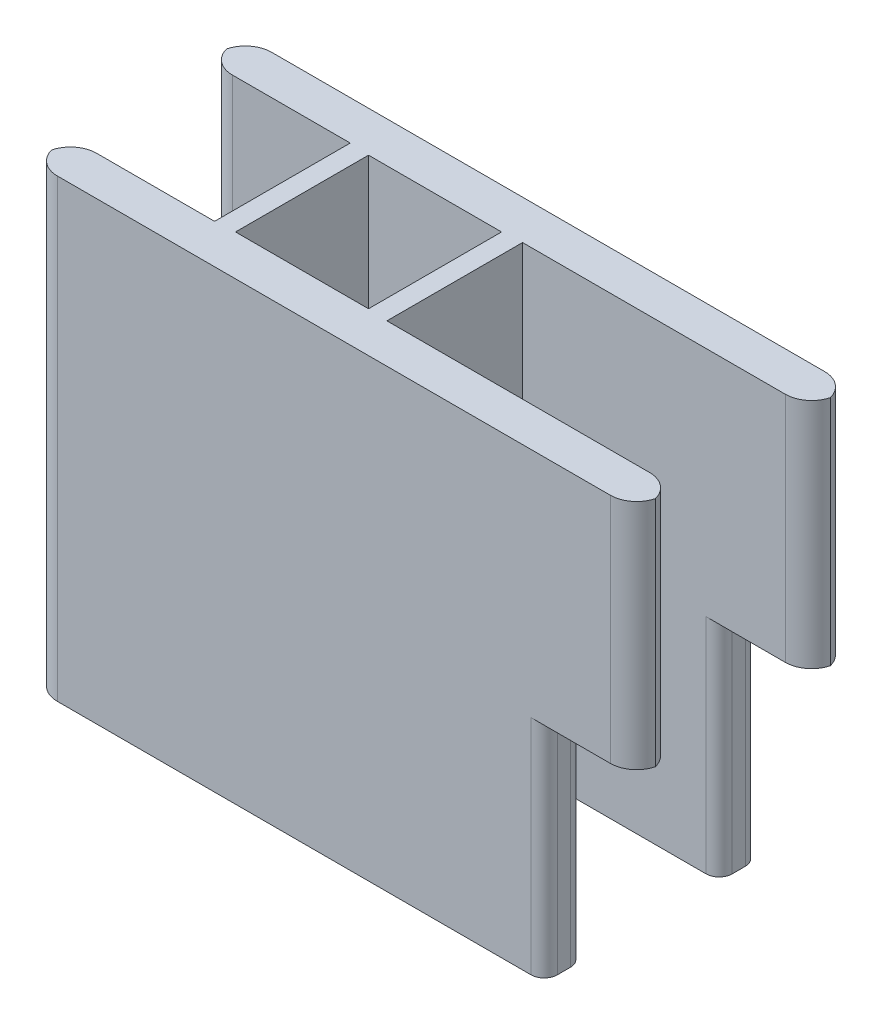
ISO-10303-21;
HEADER;
FILE_DESCRIPTION(('STEP AP214'),'2;1');
FILE_NAME('part.step','',(''),(''),'','','');
FILE_SCHEMA(('AUTOMOTIVE_DESIGN { 1 0 10303 214 1 1 1 1 }'));
ENDSEC;
DATA;
#1=APPLICATION_CONTEXT('core data for automotive mechanical design processes');
#2=APPLICATION_PROTOCOL_DEFINITION('international standard','automotive_design',2000,#1);
#3=PRODUCT_CONTEXT('',#1,'mechanical');
#4=PRODUCT('Part','Part','',(#3));
#5=PRODUCT_RELATED_PRODUCT_CATEGORY('part','',(#4));
#6=PRODUCT_DEFINITION_FORMATION('','',#4);
#7=PRODUCT_DEFINITION_CONTEXT('part definition',#1,'design');
#8=PRODUCT_DEFINITION('design','',#6,#7);
#9=PRODUCT_DEFINITION_SHAPE('','',#8);
#10=(LENGTH_UNIT() NAMED_UNIT(*) SI_UNIT(.MILLI.,.METRE.));
#11=(NAMED_UNIT(*) PLANE_ANGLE_UNIT() SI_UNIT($,.RADIAN.));
#12=(NAMED_UNIT(*) SI_UNIT($,.STERADIAN.) SOLID_ANGLE_UNIT());
#13=UNCERTAINTY_MEASURE_WITH_UNIT(LENGTH_MEASURE(1.E-05),#10,'distance_accuracy_value','');
#14=(GEOMETRIC_REPRESENTATION_CONTEXT(3) GLOBAL_UNCERTAINTY_ASSIGNED_CONTEXT((#13)) GLOBAL_UNIT_ASSIGNED_CONTEXT((#10,
#11,#12)) REPRESENTATION_CONTEXT('',''));
#15=CARTESIAN_POINT('',(0.,0.,0.));
#16=DIRECTION('',(0.,0.,1.));
#17=DIRECTION('',(1.,0.,0.));
#18=AXIS2_PLACEMENT_3D('',#15,#16,#17);
#19=CARTESIAN_POINT('',(-31.6666666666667,50.,-17.1833333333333));
#20=DIRECTION('',(0.,0.,-1.));
#21=DIRECTION('',(-1.,0.,0.));
#22=AXIS2_PLACEMENT_3D('',#19,#20,#21);
#23=PLANE('',#22);
#24=DIRECTION('',(1.,0.,0.));
#25=VECTOR('',#24,1.);
#26=CARTESIAN_POINT('',(-31.6666666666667,67.72,-17.1833333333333));
#27=LINE('',#26,#25);
#28=CARTESIAN_POINT('',(-29.6666666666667,67.72,-17.1833333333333));
#29=VERTEX_POINT('',#28);
#30=CARTESIAN_POINT('',(-20.6666666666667,67.72,-17.1833333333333));
#31=VERTEX_POINT('',#30);
#32=EDGE_CURVE('E257',#29,#31,#27,.T.);
#33=ORIENTED_EDGE('',*,*,#32,.F.);
#34=DIRECTION('',(0.,-1.,0.));
#35=VECTOR('',#34,1.);
#36=CARTESIAN_POINT('',(-29.6666666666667,50.,-17.1833333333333));
#37=LINE('',#36,#35);
#38=CARTESIAN_POINT('',(-29.6666666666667,33.,-17.1833333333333));
#39=VERTEX_POINT('',#38);
#40=EDGE_CURVE('E11',#29,#39,#37,.T.);
#41=ORIENTED_EDGE('',*,*,#40,.T.);
#42=DIRECTION('',(-1.,0.,0.));
#43=VECTOR('',#42,1.);
#44=CARTESIAN_POINT('',(-31.6666666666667,33.,-17.1833333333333));
#45=LINE('',#44,#43);
#46=CARTESIAN_POINT('',(-20.6666666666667,33.,-17.1833333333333));
#47=VERTEX_POINT('',#46);
#48=EDGE_CURVE('E310',#47,#39,#45,.T.);
#49=ORIENTED_EDGE('',*,*,#48,.F.);
#50=DIRECTION('',(0.,-1.,0.));
#51=VECTOR('',#50,1.);
#52=CARTESIAN_POINT('',(-20.6666666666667,50.,-17.1833333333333));
#53=LINE('',#52,#51);
#54=EDGE_CURVE('E345',#31,#47,#53,.T.);
#55=ORIENTED_EDGE('',*,*,#54,.F.);
#56=EDGE_LOOP('',(#33,#41,#49,#55));
#57=FACE_BOUND('',#56,.T.);
#58=ADVANCED_FACE('F34',(#57),#23,.F.);
#59=CARTESIAN_POINT('',(-20.6666666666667,50.,-17.1833333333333));
#60=DIRECTION('',(1.,0.,0.));
#61=DIRECTION('',(0.,0.,-1.));
#62=AXIS2_PLACEMENT_3D('',#59,#60,#61);
#63=PLANE('',#62);
#64=DIRECTION('',(0.,0.,-1.));
#65=VECTOR('',#64,1.);
#66=CARTESIAN_POINT('',(-20.6666666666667,33.,-17.1833333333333));
#67=LINE('',#66,#65);
#68=CARTESIAN_POINT('',(-20.6666666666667,33.,-6.83333333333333));
#69=VERTEX_POINT('',#68);
#70=EDGE_CURVE('E308',#69,#47,#67,.T.);
#71=ORIENTED_EDGE('',*,*,#70,.F.);
#72=DIRECTION('',(0.,-1.,0.));
#73=VECTOR('',#72,1.);
#74=CARTESIAN_POINT('',(-20.6666666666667,50.,-6.83333333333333));
#75=LINE('',#74,#73);
#76=CARTESIAN_POINT('',(-20.6666666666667,67.72,-6.83333333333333));
#77=VERTEX_POINT('',#76);
#78=EDGE_CURVE('E342',#77,#69,#75,.T.);
#79=ORIENTED_EDGE('',*,*,#78,.F.);
#80=DIRECTION('',(0.,0.,1.));
#81=VECTOR('',#80,1.);
#82=CARTESIAN_POINT('',(-20.6666666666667,67.72,-6.83333333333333));
#83=LINE('',#82,#81);
#84=EDGE_CURVE('E260',#31,#77,#83,.T.);
#85=ORIENTED_EDGE('',*,*,#84,.F.);
#86=ORIENTED_EDGE('',*,*,#54,.T.);
#87=EDGE_LOOP('',(#71,#79,#85,#86));
#88=FACE_BOUND('',#87,.T.);
#89=ADVANCED_FACE('F454',(#88),#63,.F.);
#90=CARTESIAN_POINT('',(-31.6666666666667,50.,-6.83333333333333));
#91=DIRECTION('',(0.,0.,1.));
#92=DIRECTION('',(1.,0.,0.));
#93=AXIS2_PLACEMENT_3D('',#90,#91,#92);
#94=PLANE('',#93);
#95=DIRECTION('',(1.,0.,0.));
#96=VECTOR('',#95,1.);
#97=CARTESIAN_POINT('',(-31.6666666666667,33.,-6.83333333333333));
#98=LINE('',#97,#96);
#99=CARTESIAN_POINT('',(-29.6666666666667,33.,-6.83333333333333));
#100=VERTEX_POINT('',#99);
#101=EDGE_CURVE('E306',#100,#69,#98,.T.);
#102=ORIENTED_EDGE('',*,*,#101,.F.);
#103=DIRECTION('',(0.,-1.,0.));
#104=VECTOR('',#103,1.);
#105=CARTESIAN_POINT('',(-29.6666666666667,50.,-6.83333333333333));
#106=LINE('',#105,#104);
#107=CARTESIAN_POINT('',(-29.6666666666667,67.72,-6.83333333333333));
#108=VERTEX_POINT('',#107);
#109=EDGE_CURVE('E43',#100,#108,#106,.F.);
#110=ORIENTED_EDGE('',*,*,#109,.T.);
#111=DIRECTION('',(-1.,0.,0.));
#112=VECTOR('',#111,1.);
#113=CARTESIAN_POINT('',(-20.6666666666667,67.72,-6.83333333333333));
#114=LINE('',#113,#112);
#115=EDGE_CURVE('E263',#77,#108,#114,.T.);
#116=ORIENTED_EDGE('',*,*,#115,.F.);
#117=ORIENTED_EDGE('',*,*,#78,.T.);
#118=EDGE_LOOP('',(#102,#110,#116,#117));
#119=FACE_BOUND('',#118,.T.);
#120=ADVANCED_FACE('F458',(#119),#94,.F.);
#121=CARTESIAN_POINT('',(-31.6666666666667,50.,-3.83333333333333));
#122=DIRECTION('',(0.,0.,-1.));
#123=DIRECTION('',(-1.,0.,0.));
#124=AXIS2_PLACEMENT_3D('',#121,#122,#123);
#125=PLANE('',#124);
#126=DIRECTION('',(1.,0.,0.));
#127=VECTOR('',#126,1.);
#128=CARTESIAN_POINT('',(14.536816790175,50.,-3.83333333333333));
#129=LINE('',#128,#127);
#130=CARTESIAN_POINT('',(6.48333333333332,50.,-3.83333333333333));
#131=VERTEX_POINT('',#130);
#132=CARTESIAN_POINT('',(12.536816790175,50.,-3.83333333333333));
#133=VERTEX_POINT('',#132);
#134=EDGE_CURVE('E253',#131,#133,#129,.T.);
#135=ORIENTED_EDGE('',*,*,#134,.T.);
#136=DIRECTION('',(0.,-1.,0.));
#137=VECTOR('',#136,1.);
#138=CARTESIAN_POINT('',(12.536816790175,50.,-3.83333333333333));
#139=LINE('',#138,#137);
#140=CARTESIAN_POINT('',(12.536816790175,67.72,-3.83333333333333));
#141=VERTEX_POINT('',#140);
#142=EDGE_CURVE('E420',#133,#141,#139,.F.);
#143=ORIENTED_EDGE('',*,*,#142,.T.);
#144=DIRECTION('',(1.,0.,0.));
#145=VECTOR('',#144,1.);
#146=CARTESIAN_POINT('',(-31.6666666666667,67.72,-3.83333333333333));
#147=LINE('',#146,#145);
#148=CARTESIAN_POINT('',(-29.6666666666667,67.72,-3.83333333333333));
#149=VERTEX_POINT('',#148);
#150=EDGE_CURVE('E266',#149,#141,#147,.T.);
#151=ORIENTED_EDGE('',*,*,#150,.F.);
#152=DIRECTION('',(0.,-1.,0.));
#153=VECTOR('',#152,1.);
#154=CARTESIAN_POINT('',(-29.6666666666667,50.,-3.83333333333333));
#155=LINE('',#154,#153);
#156=CARTESIAN_POINT('',(-29.6666666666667,33.,-3.83333333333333));
#157=VERTEX_POINT('',#156);
#158=EDGE_CURVE('E418',#149,#157,#155,.T.);
#159=ORIENTED_EDGE('',*,*,#158,.T.);
#160=DIRECTION('',(-1.,0.,0.));
#161=VECTOR('',#160,1.);
#162=CARTESIAN_POINT('',(-31.6666666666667,33.,-3.83333333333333));
#163=LINE('',#162,#161);
#164=CARTESIAN_POINT('',(6.48333333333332,33.,-3.83333333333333));
#165=VERTEX_POINT('',#164);
#166=EDGE_CURVE('E297',#165,#157,#163,.T.);
#167=ORIENTED_EDGE('',*,*,#166,.F.);
#168=DIRECTION('',(0.,-1.,0.));
#169=VECTOR('',#168,1.);
#170=CARTESIAN_POINT('',(6.48333333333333,50.,-3.83333333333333));
#171=LINE('',#170,#169);
#172=EDGE_CURVE('E367',#165,#131,#171,.F.);
#173=ORIENTED_EDGE('',*,*,#172,.T.);
#174=EDGE_LOOP('',(#135,#143,#151,#159,#167,#173));
#175=FACE_BOUND('',#174,.T.);
#176=ADVANCED_FACE('F468',(#175),#125,.F.);
#177=CARTESIAN_POINT('',(7.48333333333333,50.,-6.83333333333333));
#178=DIRECTION('',(-1.,0.,0.));
#179=DIRECTION('',(0.,0.,1.));
#180=AXIS2_PLACEMENT_3D('',#177,#178,#179);
#181=PLANE('',#180);
#182=DIRECTION('',(0.,0.,1.));
#183=VECTOR('',#182,1.);
#184=CARTESIAN_POINT('',(7.48333333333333,33.,-6.83333333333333));
#185=LINE('',#184,#183);
#186=CARTESIAN_POINT('',(7.48333333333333,33.,-5.83333333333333));
#187=VERTEX_POINT('',#186);
#188=CARTESIAN_POINT('',(7.48333333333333,33.,-4.83333333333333));
#189=VERTEX_POINT('',#188);
#190=EDGE_CURVE('E290',#187,#189,#185,.T.);
#191=ORIENTED_EDGE('',*,*,#190,.F.);
#192=DIRECTION('',(0.,-1.,0.));
#193=VECTOR('',#192,1.);
#194=CARTESIAN_POINT('',(7.48333333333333,50.,-5.83333333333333));
#195=LINE('',#194,#193);
#196=CARTESIAN_POINT('',(7.48333333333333,50.,-5.83333333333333));
#197=VERTEX_POINT('',#196);
#198=EDGE_CURVE('E369',#187,#197,#195,.F.);
#199=ORIENTED_EDGE('',*,*,#198,.T.);
#200=DIRECTION('',(0.,0.,-1.));
#201=VECTOR('',#200,1.);
#202=CARTESIAN_POINT('',(7.48333333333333,50.,-6.83333333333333));
#203=LINE('',#202,#201);
#204=CARTESIAN_POINT('',(7.48333333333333,50.,-4.83333333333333));
#205=VERTEX_POINT('',#204);
#206=EDGE_CURVE('E232',#205,#197,#203,.T.);
#207=ORIENTED_EDGE('',*,*,#206,.F.);
#208=DIRECTION('',(0.,-1.,0.));
#209=VECTOR('',#208,1.);
#210=CARTESIAN_POINT('',(7.48333333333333,50.,-4.83333333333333));
#211=LINE('',#210,#209);
#212=EDGE_CURVE('E477',#205,#189,#211,.T.);
#213=ORIENTED_EDGE('',*,*,#212,.T.);
#214=EDGE_LOOP('',(#191,#199,#207,#213));
#215=FACE_BOUND('',#214,.T.);
#216=ADVANCED_FACE('F479',(#215),#181,.F.);
#217=CARTESIAN_POINT('',(-7.51666666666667,50.,-6.83333333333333));
#218=DIRECTION('',(0.,0.,1.));
#219=DIRECTION('',(1.,0.,0.));
#220=AXIS2_PLACEMENT_3D('',#217,#218,#219);
#221=PLANE('',#220);
#222=DIRECTION('',(-1.,0.,0.));
#223=VECTOR('',#222,1.);
#224=CARTESIAN_POINT('',(-7.51666666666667,67.72,-6.83333333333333));
#225=LINE('',#224,#223);
#226=CARTESIAN_POINT('',(12.536816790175,67.72,-6.83333333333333));
#227=VERTEX_POINT('',#226);
#228=CARTESIAN_POINT('',(-7.51666666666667,67.72,-6.83333333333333));
#229=VERTEX_POINT('',#228);
#230=EDGE_CURVE('E269',#227,#229,#225,.T.);
#231=ORIENTED_EDGE('',*,*,#230,.F.);
#232=DIRECTION('',(0.,-1.,0.));
#233=VECTOR('',#232,1.);
#234=CARTESIAN_POINT('',(12.536816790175,50.,-6.83333333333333));
#235=LINE('',#234,#233);
#236=CARTESIAN_POINT('',(12.536816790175,50.,-6.83333333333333));
#237=VERTEX_POINT('',#236);
#238=EDGE_CURVE('E410',#227,#237,#235,.T.);
#239=ORIENTED_EDGE('',*,*,#238,.T.);
#240=DIRECTION('',(-1.,0.,0.));
#241=VECTOR('',#240,1.);
#242=CARTESIAN_POINT('',(-7.51666666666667,50.,-6.83333333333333));
#243=LINE('',#242,#241);
#244=CARTESIAN_POINT('',(6.48333333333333,50.,-6.83333333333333));
#245=VERTEX_POINT('',#244);
#246=EDGE_CURVE('E286',#237,#245,#243,.T.);
#247=ORIENTED_EDGE('',*,*,#246,.T.);
#248=DIRECTION('',(0.,-1.,0.));
#249=VECTOR('',#248,1.);
#250=CARTESIAN_POINT('',(6.48333333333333,50.,-6.83333333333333));
#251=LINE('',#250,#249);
#252=CARTESIAN_POINT('',(6.48333333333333,33.,-6.83333333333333));
#253=VERTEX_POINT('',#252);
#254=EDGE_CURVE('E360',#245,#253,#251,.T.);
#255=ORIENTED_EDGE('',*,*,#254,.T.);
#256=DIRECTION('',(1.,0.,0.));
#257=VECTOR('',#256,1.);
#258=CARTESIAN_POINT('',(-7.51666666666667,33.,-6.83333333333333));
#259=LINE('',#258,#257);
#260=CARTESIAN_POINT('',(-7.51666666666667,33.,-6.83333333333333));
#261=VERTEX_POINT('',#260);
#262=EDGE_CURVE('E277',#261,#253,#259,.T.);
#263=ORIENTED_EDGE('',*,*,#262,.F.);
#264=DIRECTION('',(0.,-1.,0.));
#265=VECTOR('',#264,1.);
#266=CARTESIAN_POINT('',(-7.51666666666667,50.,-6.83333333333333));
#267=LINE('',#266,#265);
#268=EDGE_CURVE('E339',#229,#261,#267,.T.);
#269=ORIENTED_EDGE('',*,*,#268,.F.);
#270=EDGE_LOOP('',(#231,#239,#247,#255,#263,#269));
#271=FACE_BOUND('',#270,.T.);
#272=ADVANCED_FACE('F543',(#271),#221,.F.);
#273=CARTESIAN_POINT('',(-7.51666666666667,50.,-17.1833333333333));
#274=DIRECTION('',(-1.,0.,0.));
#275=DIRECTION('',(0.,0.,1.));
#276=AXIS2_PLACEMENT_3D('',#273,#274,#275);
#277=PLANE('',#276);
#278=DIRECTION('',(0.,0.,1.));
#279=VECTOR('',#278,1.);
#280=CARTESIAN_POINT('',(-7.51666666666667,33.,-17.1833333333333));
#281=LINE('',#280,#279);
#282=CARTESIAN_POINT('',(-7.51666666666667,33.,-17.1833333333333));
#283=VERTEX_POINT('',#282);
#284=EDGE_CURVE('E295',#283,#261,#281,.T.);
#285=ORIENTED_EDGE('',*,*,#284,.F.);
#286=DIRECTION('',(0.,-1.,0.));
#287=VECTOR('',#286,1.);
#288=CARTESIAN_POINT('',(-7.51666666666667,50.,-17.1833333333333));
#289=LINE('',#288,#287);
#290=CARTESIAN_POINT('',(-7.51666666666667,67.72,-17.1833333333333));
#291=VERTEX_POINT('',#290);
#292=EDGE_CURVE('E336',#291,#283,#289,.T.);
#293=ORIENTED_EDGE('',*,*,#292,.F.);
#294=DIRECTION('',(0.,0.,-1.));
#295=VECTOR('',#294,1.);
#296=CARTESIAN_POINT('',(-7.51666666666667,67.72,-17.1833333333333));
#297=LINE('',#296,#295);
#298=EDGE_CURVE('E271',#229,#291,#297,.T.);
#299=ORIENTED_EDGE('',*,*,#298,.F.);
#300=ORIENTED_EDGE('',*,*,#268,.T.);
#301=EDGE_LOOP('',(#285,#293,#299,#300));
#302=FACE_BOUND('',#301,.T.);
#303=ADVANCED_FACE('F538',(#302),#277,.F.);
#304=CARTESIAN_POINT('',(-7.51666666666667,50.,-17.1833333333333));
#305=DIRECTION('',(0.,0.,-1.));
#306=DIRECTION('',(-1.,0.,0.));
#307=AXIS2_PLACEMENT_3D('',#304,#305,#306);
#308=PLANE('',#307);
#309=DIRECTION('',(1.,0.,0.));
#310=VECTOR('',#309,1.);
#311=CARTESIAN_POINT('',(14.536816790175,50.,-17.1833333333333));
#312=LINE('',#311,#310);
#313=CARTESIAN_POINT('',(6.48333333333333,50.,-17.1833333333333));
#314=VERTEX_POINT('',#313);
#315=CARTESIAN_POINT('',(12.536816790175,50.,-17.1833333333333));
#316=VERTEX_POINT('',#315);
#317=EDGE_CURVE('E287',#314,#316,#312,.T.);
#318=ORIENTED_EDGE('',*,*,#317,.T.);
#319=DIRECTION('',(0.,-1.,0.));
#320=VECTOR('',#319,1.);
#321=CARTESIAN_POINT('',(12.536816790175,50.,-17.1833333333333));
#322=LINE('',#321,#320);
#323=CARTESIAN_POINT('',(12.536816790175,67.72,-17.1833333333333));
#324=VERTEX_POINT('',#323);
#325=EDGE_CURVE('E408',#316,#324,#322,.F.);
#326=ORIENTED_EDGE('',*,*,#325,.T.);
#327=DIRECTION('',(1.,0.,0.));
#328=VECTOR('',#327,1.);
#329=CARTESIAN_POINT('',(14.536816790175,67.72,-17.1833333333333));
#330=LINE('',#329,#328);
#331=EDGE_CURVE('E274',#291,#324,#330,.T.);
#332=ORIENTED_EDGE('',*,*,#331,.F.);
#333=ORIENTED_EDGE('',*,*,#292,.T.);
#334=DIRECTION('',(-1.,0.,0.));
#335=VECTOR('',#334,1.);
#336=CARTESIAN_POINT('',(-7.51666666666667,33.,-17.1833333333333));
#337=LINE('',#336,#335);
#338=CARTESIAN_POINT('',(6.48333333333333,33.,-17.1833333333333));
#339=VERTEX_POINT('',#338);
#340=EDGE_CURVE('E299',#339,#283,#337,.T.);
#341=ORIENTED_EDGE('',*,*,#340,.F.);
#342=DIRECTION('',(0.,-1.,0.));
#343=VECTOR('',#342,1.);
#344=CARTESIAN_POINT('',(6.48333333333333,50.,-17.1833333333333));
#345=LINE('',#344,#343);
#346=EDGE_CURVE('E364',#339,#314,#345,.F.);
#347=ORIENTED_EDGE('',*,*,#346,.T.);
#348=EDGE_LOOP('',(#318,#326,#332,#333,#341,#347));
#349=FACE_BOUND('',#348,.T.);
#350=ADVANCED_FACE('F532',(#349),#308,.F.);
#351=CARTESIAN_POINT('',(7.48333333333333,50.,-20.1833333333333));
#352=DIRECTION('',(-1.,0.,0.));
#353=DIRECTION('',(0.,0.,1.));
#354=AXIS2_PLACEMENT_3D('',#351,#352,#353);
#355=PLANE('',#354);
#356=DIRECTION('',(0.,0.,1.));
#357=VECTOR('',#356,1.);
#358=CARTESIAN_POINT('',(7.48333333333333,33.,-20.1833333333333));
#359=LINE('',#358,#357);
#360=CARTESIAN_POINT('',(7.48333333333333,33.,-19.1833333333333));
#361=VERTEX_POINT('',#360);
#362=CARTESIAN_POINT('',(7.48333333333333,33.,-18.1833333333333));
#363=VERTEX_POINT('',#362);
#364=EDGE_CURVE('E304',#361,#363,#359,.T.);
#365=ORIENTED_EDGE('',*,*,#364,.F.);
#366=DIRECTION('',(0.,-1.,0.));
#367=VECTOR('',#366,1.);
#368=CARTESIAN_POINT('',(7.48333333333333,50.,-19.1833333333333));
#369=LINE('',#368,#367);
#370=CARTESIAN_POINT('',(7.48333333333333,50.,-19.1833333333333));
#371=VERTEX_POINT('',#370);
#372=EDGE_CURVE('E484',#361,#371,#369,.F.);
#373=ORIENTED_EDGE('',*,*,#372,.T.);
#374=DIRECTION('',(0.,0.,-1.));
#375=VECTOR('',#374,1.);
#376=CARTESIAN_POINT('',(7.48333333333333,50.,-20.1833333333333));
#377=LINE('',#376,#375);
#378=CARTESIAN_POINT('',(7.48333333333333,50.,-18.1833333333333));
#379=VERTEX_POINT('',#378);
#380=EDGE_CURVE('E333',#379,#371,#377,.T.);
#381=ORIENTED_EDGE('',*,*,#380,.F.);
#382=DIRECTION('',(0.,-1.,0.));
#383=VECTOR('',#382,1.);
#384=CARTESIAN_POINT('',(7.48333333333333,50.,-18.1833333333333));
#385=LINE('',#384,#383);
#386=EDGE_CURVE('E481',#379,#363,#385,.T.);
#387=ORIENTED_EDGE('',*,*,#386,.T.);
#388=EDGE_LOOP('',(#365,#373,#381,#387));
#389=FACE_BOUND('',#388,.T.);
#390=ADVANCED_FACE('F511',(#389),#355,.F.);
#391=CARTESIAN_POINT('',(-31.6666666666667,50.,-20.1833333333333));
#392=DIRECTION('',(0.,0.,1.));
#393=DIRECTION('',(1.,0.,0.));
#394=AXIS2_PLACEMENT_3D('',#391,#392,#393);
#395=PLANE('',#394);
#396=DIRECTION('',(-1.,0.,0.));
#397=VECTOR('',#396,1.);
#398=CARTESIAN_POINT('',(-20.6666666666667,67.72,-20.1833333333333));
#399=LINE('',#398,#397);
#400=CARTESIAN_POINT('',(12.536816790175,67.72,-20.1833333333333));
#401=VERTEX_POINT('',#400);
#402=CARTESIAN_POINT('',(-29.6666666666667,67.72,-20.1833333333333));
#403=VERTEX_POINT('',#402);
#404=EDGE_CURVE('E254',#401,#403,#399,.T.);
#405=ORIENTED_EDGE('',*,*,#404,.F.);
#406=DIRECTION('',(0.,-1.,0.));
#407=VECTOR('',#406,1.);
#408=CARTESIAN_POINT('',(12.536816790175,50.,-20.1833333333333));
#409=LINE('',#408,#407);
#410=CARTESIAN_POINT('',(12.536816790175,50.,-20.1833333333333));
#411=VERTEX_POINT('',#410);
#412=EDGE_CURVE('E385',#401,#411,#409,.T.);
#413=ORIENTED_EDGE('',*,*,#412,.T.);
#414=DIRECTION('',(-1.,0.,0.));
#415=VECTOR('',#414,1.);
#416=CARTESIAN_POINT('',(-20.6666666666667,50.,-20.1833333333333));
#417=LINE('',#416,#415);
#418=CARTESIAN_POINT('',(6.48333333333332,50.,-20.1833333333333));
#419=VERTEX_POINT('',#418);
#420=EDGE_CURVE('E258',#411,#419,#417,.T.);
#421=ORIENTED_EDGE('',*,*,#420,.T.);
#422=DIRECTION('',(0.,-1.,0.));
#423=VECTOR('',#422,1.);
#424=CARTESIAN_POINT('',(6.48333333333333,50.,-20.1833333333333));
#425=LINE('',#424,#423);
#426=CARTESIAN_POINT('',(6.48333333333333,33.,-20.1833333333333));
#427=VERTEX_POINT('',#426);
#428=EDGE_CURVE('E370',#419,#427,#425,.T.);
#429=ORIENTED_EDGE('',*,*,#428,.T.);
#430=DIRECTION('',(1.,0.,0.));
#431=VECTOR('',#430,1.);
#432=CARTESIAN_POINT('',(-31.6666666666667,33.,-20.1833333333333));
#433=LINE('',#432,#431);
#434=CARTESIAN_POINT('',(-29.6666666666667,33.,-20.1833333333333));
#435=VERTEX_POINT('',#434);
#436=EDGE_CURVE('E315',#435,#427,#433,.T.);
#437=ORIENTED_EDGE('',*,*,#436,.F.);
#438=DIRECTION('',(0.,-1.,0.));
#439=VECTOR('',#438,1.);
#440=CARTESIAN_POINT('',(-29.6666666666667,50.,-20.1833333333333));
#441=LINE('',#440,#439);
#442=EDGE_CURVE('E380',#435,#403,#441,.F.);
#443=ORIENTED_EDGE('',*,*,#442,.T.);
#444=EDGE_LOOP('',(#405,#413,#421,#429,#437,#443));
#445=FACE_BOUND('',#444,.T.);
#446=ADVANCED_FACE('F520',(#445),#395,.F.);
#447=CARTESIAN_POINT('',(-19.1666666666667,50.,-6.93083333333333));
#448=DIRECTION('',(1.,0.,0.));
#449=DIRECTION('',(0.,0.,-1.));
#450=AXIS2_PLACEMENT_3D('',#447,#448,#449);
#451=PLANE('',#450);
#452=DIRECTION('',(0.,-1.,0.));
#453=VECTOR('',#452,1.);
#454=CARTESIAN_POINT('',(-19.1666666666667,50.,-6.93083333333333));
#455=LINE('',#454,#453);
#456=CARTESIAN_POINT('',(-19.1666666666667,67.72,-6.93083333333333));
#457=VERTEX_POINT('',#456);
#458=CARTESIAN_POINT('',(-19.1666666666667,33.,-6.93083333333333));
#459=VERTEX_POINT('',#458);
#460=EDGE_CURVE('E222',#457,#459,#455,.T.);
#461=ORIENTED_EDGE('',*,*,#460,.T.);
#462=DIRECTION('',(0.,0.,-1.));
#463=VECTOR('',#462,1.);
#464=CARTESIAN_POINT('',(-19.1666666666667,33.,-6.93083333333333));
#465=LINE('',#464,#463);
#466=CARTESIAN_POINT('',(-19.1666666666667,33.,-17.0808333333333));
#467=VERTEX_POINT('',#466);
#468=EDGE_CURVE('E324',#459,#467,#465,.T.);
#469=ORIENTED_EDGE('',*,*,#468,.T.);
#470=DIRECTION('',(0.,-1.,0.));
#471=VECTOR('',#470,1.);
#472=CARTESIAN_POINT('',(-19.1666666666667,50.,-17.0808333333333));
#473=LINE('',#472,#471);
#474=CARTESIAN_POINT('',(-19.1666666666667,67.72,-17.0808333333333));
#475=VERTEX_POINT('',#474);
#476=EDGE_CURVE('E239',#475,#467,#473,.T.);
#477=ORIENTED_EDGE('',*,*,#476,.F.);
#478=DIRECTION('',(0.,0.,1.));
#479=VECTOR('',#478,1.);
#480=CARTESIAN_POINT('',(-19.1666666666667,67.72,-17.0808333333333));
#481=LINE('',#480,#479);
#482=EDGE_CURVE('E236',#475,#457,#481,.T.);
#483=ORIENTED_EDGE('',*,*,#482,.T.);
#484=EDGE_LOOP('',(#461,#469,#477,#483));
#485=FACE_BOUND('',#484,.T.);
#486=ADVANCED_FACE('F237',(#485),#451,.T.);
#487=CARTESIAN_POINT('',(-19.1666666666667,50.,-6.93083333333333));
#488=DIRECTION('',(0.,0.,-1.));
#489=DIRECTION('',(-1.,0.,0.));
#490=AXIS2_PLACEMENT_3D('',#487,#488,#489);
#491=PLANE('',#490);
#492=DIRECTION('',(0.,-1.,0.));
#493=VECTOR('',#492,1.);
#494=CARTESIAN_POINT('',(-9.01666666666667,50.,-6.93083333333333));
#495=LINE('',#494,#493);
#496=CARTESIAN_POINT('',(-9.01666666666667,67.72,-6.93083333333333));
#497=VERTEX_POINT('',#496);
#498=CARTESIAN_POINT('',(-9.01666666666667,33.,-6.93083333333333));
#499=VERTEX_POINT('',#498);
#500=EDGE_CURVE('E233',#497,#499,#495,.T.);
#501=ORIENTED_EDGE('',*,*,#500,.T.);
#502=DIRECTION('',(-1.,0.,0.));
#503=VECTOR('',#502,1.);
#504=CARTESIAN_POINT('',(-19.1666666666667,33.,-6.93083333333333));
#505=LINE('',#504,#503);
#506=EDGE_CURVE('E229',#499,#459,#505,.T.);
#507=ORIENTED_EDGE('',*,*,#506,.T.);
#508=ORIENTED_EDGE('',*,*,#460,.F.);
#509=DIRECTION('',(1.,0.,0.));
#510=VECTOR('',#509,1.);
#511=CARTESIAN_POINT('',(-19.1666666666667,67.72,-6.93083333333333));
#512=LINE('',#511,#510);
#513=EDGE_CURVE('E227',#457,#497,#512,.T.);
#514=ORIENTED_EDGE('',*,*,#513,.T.);
#515=EDGE_LOOP('',(#501,#507,#508,#514));
#516=FACE_BOUND('',#515,.T.);
#517=ADVANCED_FACE('F225',(#516),#491,.T.);
#518=CARTESIAN_POINT('',(-9.01666666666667,50.,-6.93083333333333));
#519=DIRECTION('',(-1.,0.,0.));
#520=DIRECTION('',(0.,0.,1.));
#521=AXIS2_PLACEMENT_3D('',#518,#519,#520);
#522=PLANE('',#521);
#523=DIRECTION('',(0.,-1.,0.));
#524=VECTOR('',#523,1.);
#525=CARTESIAN_POINT('',(-9.01666666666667,50.,-17.0808333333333));
#526=LINE('',#525,#524);
#527=CARTESIAN_POINT('',(-9.01666666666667,67.72,-17.0808333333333));
#528=VERTEX_POINT('',#527);
#529=CARTESIAN_POINT('',(-9.01666666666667,33.,-17.0808333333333));
#530=VERTEX_POINT('',#529);
#531=EDGE_CURVE('E327',#528,#530,#526,.T.);
#532=ORIENTED_EDGE('',*,*,#531,.T.);
#533=DIRECTION('',(0.,0.,1.));
#534=VECTOR('',#533,1.);
#535=CARTESIAN_POINT('',(-9.01666666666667,33.,-6.93083333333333));
#536=LINE('',#535,#534);
#537=EDGE_CURVE('E320',#530,#499,#536,.T.);
#538=ORIENTED_EDGE('',*,*,#537,.T.);
#539=ORIENTED_EDGE('',*,*,#500,.F.);
#540=DIRECTION('',(0.,0.,-1.));
#541=VECTOR('',#540,1.);
#542=CARTESIAN_POINT('',(-9.01666666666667,67.72,-17.0808333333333));
#543=LINE('',#542,#541);
#544=EDGE_CURVE('E247',#497,#528,#543,.T.);
#545=ORIENTED_EDGE('',*,*,#544,.T.);
#546=EDGE_LOOP('',(#532,#538,#539,#545));
#547=FACE_BOUND('',#546,.T.);
#548=ADVANCED_FACE('F605',(#547),#522,.T.);
#549=CARTESIAN_POINT('',(-19.1666666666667,50.,-17.0808333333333));
#550=DIRECTION('',(0.,0.,1.));
#551=DIRECTION('',(1.,0.,0.));
#552=AXIS2_PLACEMENT_3D('',#549,#550,#551);
#553=PLANE('',#552);
#554=ORIENTED_EDGE('',*,*,#476,.T.);
#555=DIRECTION('',(1.,0.,0.));
#556=VECTOR('',#555,1.);
#557=CARTESIAN_POINT('',(-19.1666666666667,33.,-17.0808333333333));
#558=LINE('',#557,#556);
#559=EDGE_CURVE('E317',#467,#530,#558,.T.);
#560=ORIENTED_EDGE('',*,*,#559,.T.);
#561=ORIENTED_EDGE('',*,*,#531,.F.);
#562=DIRECTION('',(-1.,0.,0.));
#563=VECTOR('',#562,1.);
#564=CARTESIAN_POINT('',(-19.1666666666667,67.72,-17.0808333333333));
#565=LINE('',#564,#563);
#566=EDGE_CURVE('E249',#528,#475,#565,.T.);
#567=ORIENTED_EDGE('',*,*,#566,.T.);
#568=EDGE_LOOP('',(#554,#560,#561,#567));
#569=FACE_BOUND('',#568,.T.);
#570=ADVANCED_FACE('F581',(#569),#553,.T.);
#571=CARTESIAN_POINT('',(6.48333333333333,50.,-4.83333333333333));
#572=DIRECTION('',(0.,-1.,0.));
#573=DIRECTION('',(0.,0.,-1.));
#574=AXIS2_PLACEMENT_3D('',#571,#572,#573);
#575=CYLINDRICAL_SURFACE('',#574,1.);
#576=ORIENTED_EDGE('',*,*,#172,.F.);
#577=CARTESIAN_POINT('',(6.48333333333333,33.,-4.83333333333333));
#578=DIRECTION('',(0.,-1.,0.));
#579=DIRECTION('',(0.,0.,-1.));
#580=AXIS2_PLACEMENT_3D('',#577,#578,#579);
#581=CIRCLE('',#580,1.);
#582=EDGE_CURVE('E292',#165,#189,#581,.F.);
#583=ORIENTED_EDGE('',*,*,#582,.T.);
#584=ORIENTED_EDGE('',*,*,#212,.F.);
#585=CARTESIAN_POINT('',(6.48333333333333,50.,-4.83333333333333));
#586=DIRECTION('',(0.,1.,0.));
#587=DIRECTION('',(0.,0.,1.));
#588=AXIS2_PLACEMENT_3D('',#585,#586,#587);
#589=CIRCLE('',#588,1.);
#590=EDGE_CURVE('E373',#131,#205,#589,.T.);
#591=ORIENTED_EDGE('',*,*,#590,.F.);
#592=EDGE_LOOP('',(#576,#583,#584,#591));
#593=FACE_BOUND('',#592,.T.);
#594=ADVANCED_FACE('F475',(#593),#575,.T.);
#595=CARTESIAN_POINT('',(6.48333333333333,50.,-19.1833333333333));
#596=DIRECTION('',(0.,-1.,0.));
#597=DIRECTION('',(0.,0.,-1.));
#598=AXIS2_PLACEMENT_3D('',#595,#596,#597);
#599=CYLINDRICAL_SURFACE('',#598,1.);
#600=ORIENTED_EDGE('',*,*,#372,.F.);
#601=CARTESIAN_POINT('',(6.48333333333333,33.,-19.1833333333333));
#602=DIRECTION('',(0.,-1.,0.));
#603=DIRECTION('',(0.,0.,-1.));
#604=AXIS2_PLACEMENT_3D('',#601,#602,#603);
#605=CIRCLE('',#604,1.);
#606=EDGE_CURVE('E312',#361,#427,#605,.F.);
#607=ORIENTED_EDGE('',*,*,#606,.T.);
#608=ORIENTED_EDGE('',*,*,#428,.F.);
#609=CARTESIAN_POINT('',(6.48333333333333,50.,-19.1833333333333));
#610=DIRECTION('',(0.,1.,0.));
#611=DIRECTION('',(0.,0.,1.));
#612=AXIS2_PLACEMENT_3D('',#609,#610,#611);
#613=CIRCLE('',#612,1.);
#614=EDGE_CURVE('E376',#371,#419,#613,.T.);
#615=ORIENTED_EDGE('',*,*,#614,.F.);
#616=EDGE_LOOP('',(#600,#607,#608,#615));
#617=FACE_BOUND('',#616,.T.);
#618=ADVANCED_FACE('F516',(#617),#599,.T.);
#619=CARTESIAN_POINT('',(6.48333333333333,50.,-18.1833333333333));
#620=DIRECTION('',(0.,-1.,0.));
#621=DIRECTION('',(0.,0.,-1.));
#622=AXIS2_PLACEMENT_3D('',#619,#620,#621);
#623=CYLINDRICAL_SURFACE('',#622,1.);
#624=ORIENTED_EDGE('',*,*,#346,.F.);
#625=CARTESIAN_POINT('',(6.48333333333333,33.,-18.1833333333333));
#626=DIRECTION('',(0.,-1.,0.));
#627=DIRECTION('',(0.,0.,-1.));
#628=AXIS2_PLACEMENT_3D('',#625,#626,#627);
#629=CIRCLE('',#628,1.);
#630=EDGE_CURVE('E301',#339,#363,#629,.F.);
#631=ORIENTED_EDGE('',*,*,#630,.T.);
#632=ORIENTED_EDGE('',*,*,#386,.F.);
#633=CARTESIAN_POINT('',(6.48333333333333,50.,-18.1833333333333));
#634=DIRECTION('',(0.,1.,0.));
#635=DIRECTION('',(0.,0.,1.));
#636=AXIS2_PLACEMENT_3D('',#633,#634,#635);
#637=CIRCLE('',#636,1.);
#638=EDGE_CURVE('E357',#314,#379,#637,.T.);
#639=ORIENTED_EDGE('',*,*,#638,.F.);
#640=EDGE_LOOP('',(#624,#631,#632,#639));
#641=FACE_BOUND('',#640,.T.);
#642=ADVANCED_FACE('F508',(#641),#623,.T.);
#643=CARTESIAN_POINT('',(6.48333333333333,50.,-5.83333333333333));
#644=DIRECTION('',(0.,-1.,0.));
#645=DIRECTION('',(0.,0.,-1.));
#646=AXIS2_PLACEMENT_3D('',#643,#644,#645);
#647=CYLINDRICAL_SURFACE('',#646,1.);
#648=ORIENTED_EDGE('',*,*,#198,.F.);
#649=CARTESIAN_POINT('',(6.48333333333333,33.,-5.83333333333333));
#650=DIRECTION('',(0.,-1.,0.));
#651=DIRECTION('',(0.,0.,-1.));
#652=AXIS2_PLACEMENT_3D('',#649,#650,#651);
#653=CIRCLE('',#652,1.);
#654=EDGE_CURVE('E363',#187,#253,#653,.F.);
#655=ORIENTED_EDGE('',*,*,#654,.T.);
#656=ORIENTED_EDGE('',*,*,#254,.F.);
#657=CARTESIAN_POINT('',(6.48333333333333,50.,-5.83333333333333));
#658=DIRECTION('',(0.,1.,0.));
#659=DIRECTION('',(0.,0.,1.));
#660=AXIS2_PLACEMENT_3D('',#657,#658,#659);
#661=CIRCLE('',#660,1.);
#662=EDGE_CURVE('E348',#197,#245,#661,.T.);
#663=ORIENTED_EDGE('',*,*,#662,.F.);
#664=EDGE_LOOP('',(#648,#655,#656,#663));
#665=FACE_BOUND('',#664,.T.);
#666=ADVANCED_FACE('F547',(#665),#647,.T.);
#667=CARTESIAN_POINT('',(0.,33.,0.));
#668=DIRECTION('',(0.,-1.,0.));
#669=DIRECTION('',(0.,0.,-1.));
#670=AXIS2_PLACEMENT_3D('',#667,#668,#669);
#671=PLANE('',#670);
#672=ORIENTED_EDGE('',*,*,#506,.F.);
#673=ORIENTED_EDGE('',*,*,#537,.F.);
#674=ORIENTED_EDGE('',*,*,#559,.F.);
#675=ORIENTED_EDGE('',*,*,#468,.F.);
#676=EDGE_LOOP('',(#672,#673,#674,#675));
#677=FACE_BOUND('',#676,.T.);
#678=CARTESIAN_POINT('',(-29.6666666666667,33.,-19.1833333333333));
#679=DIRECTION('',(0.,-1.,0.));
#680=DIRECTION('',(0.,0.,-1.));
#681=AXIS2_PLACEMENT_3D('',#678,#679,#680);
#682=CIRCLE('',#681,2.);
#683=CARTESIAN_POINT('',(-31.6031583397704,33.,-18.6833333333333));
#684=VERTEX_POINT('',#683);
#685=EDGE_CURVE('E51',#39,#684,#682,.T.);
#686=ORIENTED_EDGE('',*,*,#685,.T.);
#687=CARTESIAN_POINT('',(-29.6666666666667,33.,-18.1833333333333));
#688=DIRECTION('',(0.,-1.,0.));
#689=DIRECTION('',(0.,0.,-1.));
#690=AXIS2_PLACEMENT_3D('',#687,#688,#689);
#691=CIRCLE('',#690,2.);
#692=EDGE_CURVE('E426',#684,#435,#691,.T.);
#693=ORIENTED_EDGE('',*,*,#692,.T.);
#694=ORIENTED_EDGE('',*,*,#436,.T.);
#695=ORIENTED_EDGE('',*,*,#606,.F.);
#696=ORIENTED_EDGE('',*,*,#364,.T.);
#697=ORIENTED_EDGE('',*,*,#630,.F.);
#698=ORIENTED_EDGE('',*,*,#340,.T.);
#699=ORIENTED_EDGE('',*,*,#284,.T.);
#700=ORIENTED_EDGE('',*,*,#262,.T.);
#701=ORIENTED_EDGE('',*,*,#654,.F.);
#702=ORIENTED_EDGE('',*,*,#190,.T.);
#703=ORIENTED_EDGE('',*,*,#582,.F.);
#704=ORIENTED_EDGE('',*,*,#166,.T.);
#705=CARTESIAN_POINT('',(-29.6666666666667,33.,-5.83333333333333));
#706=DIRECTION('',(0.,-1.,0.));
#707=DIRECTION('',(0.,0.,-1.));
#708=AXIS2_PLACEMENT_3D('',#705,#706,#707);
#709=CIRCLE('',#708,2.);
#710=CARTESIAN_POINT('',(-31.6031583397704,33.,-5.33333333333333));
#711=VERTEX_POINT('',#710);
#712=EDGE_CURVE('E58',#157,#711,#709,.T.);
#713=ORIENTED_EDGE('',*,*,#712,.T.);
#714=CARTESIAN_POINT('',(-29.6666666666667,33.,-4.83333333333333));
#715=DIRECTION('',(0.,-1.,0.));
#716=DIRECTION('',(0.,0.,-1.));
#717=AXIS2_PLACEMENT_3D('',#714,#715,#716);
#718=CIRCLE('',#717,2.);
#719=EDGE_CURVE('E423',#711,#100,#718,.T.);
#720=ORIENTED_EDGE('',*,*,#719,.T.);
#721=ORIENTED_EDGE('',*,*,#101,.T.);
#722=ORIENTED_EDGE('',*,*,#70,.T.);
#723=ORIENTED_EDGE('',*,*,#48,.T.);
#724=EDGE_LOOP('',(#686,#693,#694,#695,#696,#697,#698,#699,#700,#701,#702,#703,#704,#713,#720,
#721,#722,#723));
#725=FACE_BOUND('',#724,.T.);
#726=ADVANCED_FACE('F470',(#677,#725),#671,.T.);
#727=CARTESIAN_POINT('',(0.,50.,0.));
#728=DIRECTION('',(0.,1.,0.));
#729=DIRECTION('',(0.,0.,1.));
#730=AXIS2_PLACEMENT_3D('',#727,#728,#729);
#731=PLANE('',#730);
#732=ORIENTED_EDGE('',*,*,#246,.F.);
#733=CARTESIAN_POINT('',(12.536816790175,50.,-4.83333333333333));
#734=DIRECTION('',(0.,1.,0.));
#735=DIRECTION('',(0.,0.,1.));
#736=AXIS2_PLACEMENT_3D('',#733,#734,#735);
#737=CIRCLE('',#736,2.);
#738=CARTESIAN_POINT('',(14.4733084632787,50.,-5.33333333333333));
#739=VERTEX_POINT('',#738);
#740=EDGE_CURVE('E416',#237,#739,#737,.F.);
#741=ORIENTED_EDGE('',*,*,#740,.T.);
#742=CARTESIAN_POINT('',(12.536816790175,50.,-5.83333333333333));
#743=DIRECTION('',(0.,1.,0.));
#744=DIRECTION('',(0.,0.,1.));
#745=AXIS2_PLACEMENT_3D('',#742,#743,#744);
#746=CIRCLE('',#745,2.);
#747=EDGE_CURVE('E414',#739,#133,#746,.F.);
#748=ORIENTED_EDGE('',*,*,#747,.T.);
#749=ORIENTED_EDGE('',*,*,#134,.F.);
#750=ORIENTED_EDGE('',*,*,#590,.T.);
#751=ORIENTED_EDGE('',*,*,#206,.T.);
#752=ORIENTED_EDGE('',*,*,#662,.T.);
#753=EDGE_LOOP('',(#732,#741,#748,#749,#750,#751,#752));
#754=FACE_BOUND('',#753,.T.);
#755=ADVANCED_FACE('F551',(#754),#731,.F.);
#756=ORIENTED_EDGE('',*,*,#420,.F.);
#757=CARTESIAN_POINT('',(12.536816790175,50.,-18.1833333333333));
#758=DIRECTION('',(0.,1.,0.));
#759=DIRECTION('',(0.,0.,1.));
#760=AXIS2_PLACEMENT_3D('',#757,#758,#759);
#761=CIRCLE('',#760,2.);
#762=CARTESIAN_POINT('',(14.4733084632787,50.,-18.6833333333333));
#763=VERTEX_POINT('',#762);
#764=EDGE_CURVE('E390',#411,#763,#761,.F.);
#765=ORIENTED_EDGE('',*,*,#764,.T.);
#766=CARTESIAN_POINT('',(12.536816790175,50.,-19.1833333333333));
#767=DIRECTION('',(0.,1.,0.));
#768=DIRECTION('',(0.,0.,1.));
#769=AXIS2_PLACEMENT_3D('',#766,#767,#768);
#770=CIRCLE('',#769,2.);
#771=EDGE_CURVE('E388',#763,#316,#770,.F.);
#772=ORIENTED_EDGE('',*,*,#771,.T.);
#773=ORIENTED_EDGE('',*,*,#317,.F.);
#774=ORIENTED_EDGE('',*,*,#638,.T.);
#775=ORIENTED_EDGE('',*,*,#380,.T.);
#776=ORIENTED_EDGE('',*,*,#614,.T.);
#777=EDGE_LOOP('',(#756,#765,#772,#773,#774,#775,#776));
#778=FACE_BOUND('',#777,.T.);
#779=ADVANCED_FACE('F503',(#778),#731,.F.);
#780=CARTESIAN_POINT('',(0.,67.72,0.));
#781=DIRECTION('',(0.,1.,0.));
#782=DIRECTION('',(0.,0.,1.));
#783=AXIS2_PLACEMENT_3D('',#780,#781,#782);
#784=PLANE('',#783);
#785=CARTESIAN_POINT('',(12.536816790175,67.72,-19.1833333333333));
#786=DIRECTION('',(0.,1.,0.));
#787=DIRECTION('',(0.,0.,1.));
#788=AXIS2_PLACEMENT_3D('',#785,#786,#787);
#789=CIRCLE('',#788,2.);
#790=CARTESIAN_POINT('',(14.4733084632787,67.72,-18.6833333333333));
#791=VERTEX_POINT('',#790);
#792=EDGE_CURVE('E404',#324,#791,#789,.T.);
#793=ORIENTED_EDGE('',*,*,#792,.T.);
#794=CARTESIAN_POINT('',(12.536816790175,67.72,-18.1833333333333));
#795=DIRECTION('',(0.,1.,0.));
#796=DIRECTION('',(0.,0.,1.));
#797=AXIS2_PLACEMENT_3D('',#794,#795,#796);
#798=CIRCLE('',#797,2.);
#799=EDGE_CURVE('E406',#791,#401,#798,.T.);
#800=ORIENTED_EDGE('',*,*,#799,.T.);
#801=ORIENTED_EDGE('',*,*,#404,.T.);
#802=CARTESIAN_POINT('',(-29.6666666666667,67.72,-18.1833333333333));
#803=DIRECTION('',(0.,1.,0.));
#804=DIRECTION('',(0.,0.,1.));
#805=AXIS2_PLACEMENT_3D('',#802,#803,#804);
#806=CIRCLE('',#805,2.);
#807=CARTESIAN_POINT('',(-31.6031583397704,67.72,-18.6833333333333));
#808=VERTEX_POINT('',#807);
#809=EDGE_CURVE('E398',#403,#808,#806,.T.);
#810=ORIENTED_EDGE('',*,*,#809,.T.);
#811=CARTESIAN_POINT('',(-29.6666666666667,67.72,-19.1833333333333));
#812=DIRECTION('',(0.,1.,0.));
#813=DIRECTION('',(0.,0.,1.));
#814=AXIS2_PLACEMENT_3D('',#811,#812,#813);
#815=CIRCLE('',#814,2.);
#816=EDGE_CURVE('E396',#808,#29,#815,.T.);
#817=ORIENTED_EDGE('',*,*,#816,.T.);
#818=ORIENTED_EDGE('',*,*,#32,.T.);
#819=ORIENTED_EDGE('',*,*,#84,.T.);
#820=ORIENTED_EDGE('',*,*,#115,.T.);
#821=CARTESIAN_POINT('',(-29.6666666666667,67.72,-4.83333333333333));
#822=DIRECTION('',(0.,1.,0.));
#823=DIRECTION('',(0.,0.,1.));
#824=AXIS2_PLACEMENT_3D('',#821,#822,#823);
#825=CIRCLE('',#824,2.);
#826=CARTESIAN_POINT('',(-31.6031583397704,67.72,-5.33333333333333));
#827=VERTEX_POINT('',#826);
#828=EDGE_CURVE('E394',#108,#827,#825,.T.);
#829=ORIENTED_EDGE('',*,*,#828,.T.);
#830=CARTESIAN_POINT('',(-29.6666666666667,67.72,-5.83333333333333));
#831=DIRECTION('',(0.,1.,0.));
#832=DIRECTION('',(0.,0.,1.));
#833=AXIS2_PLACEMENT_3D('',#830,#831,#832);
#834=CIRCLE('',#833,2.);
#835=EDGE_CURVE('E392',#827,#149,#834,.T.);
#836=ORIENTED_EDGE('',*,*,#835,.T.);
#837=ORIENTED_EDGE('',*,*,#150,.T.);
#838=CARTESIAN_POINT('',(12.536816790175,67.72,-5.83333333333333));
#839=DIRECTION('',(0.,1.,0.));
#840=DIRECTION('',(0.,0.,1.));
#841=AXIS2_PLACEMENT_3D('',#838,#839,#840);
#842=CIRCLE('',#841,2.);
#843=CARTESIAN_POINT('',(14.4733084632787,67.72,-5.33333333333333));
#844=VERTEX_POINT('',#843);
#845=EDGE_CURVE('E400',#141,#844,#842,.T.);
#846=ORIENTED_EDGE('',*,*,#845,.T.);
#847=CARTESIAN_POINT('',(12.536816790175,67.72,-4.83333333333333));
#848=DIRECTION('',(0.,1.,0.));
#849=DIRECTION('',(0.,0.,1.));
#850=AXIS2_PLACEMENT_3D('',#847,#848,#849);
#851=CIRCLE('',#850,2.);
#852=EDGE_CURVE('E402',#844,#227,#851,.T.);
#853=ORIENTED_EDGE('',*,*,#852,.T.);
#854=ORIENTED_EDGE('',*,*,#230,.T.);
#855=ORIENTED_EDGE('',*,*,#298,.T.);
#856=ORIENTED_EDGE('',*,*,#331,.T.);
#857=EDGE_LOOP('',(#793,#800,#801,#810,#817,#818,#819,#820,#829,#836,#837,#846,#853,#854,#855,#856));
#858=FACE_BOUND('',#857,.T.);
#859=ORIENTED_EDGE('',*,*,#513,.F.);
#860=ORIENTED_EDGE('',*,*,#482,.F.);
#861=ORIENTED_EDGE('',*,*,#566,.F.);
#862=ORIENTED_EDGE('',*,*,#544,.F.);
#863=EDGE_LOOP('',(#859,#860,#861,#862));
#864=FACE_BOUND('',#863,.T.);
#865=ADVANCED_FACE('F245',(#858,#864),#784,.T.);
#866=CARTESIAN_POINT('',(12.536816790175,67.72,-19.1833333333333));
#867=DIRECTION('',(0.,-1.,0.));
#868=DIRECTION('',(0.,0.,-1.));
#869=AXIS2_PLACEMENT_3D('',#866,#867,#868);
#870=CYLINDRICAL_SURFACE('',#869,2.);
#871=DIRECTION('',(0.,-1.,0.));
#872=VECTOR('',#871,1.);
#873=CARTESIAN_POINT('',(14.4733084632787,58.86,-18.6833333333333));
#874=LINE('',#873,#872);
#875=EDGE_CURVE('E243',#791,#763,#874,.T.);
#876=ORIENTED_EDGE('',*,*,#875,.F.);
#877=ORIENTED_EDGE('',*,*,#792,.F.);
#878=ORIENTED_EDGE('',*,*,#325,.F.);
#879=ORIENTED_EDGE('',*,*,#771,.F.);
#880=EDGE_LOOP('',(#876,#877,#878,#879));
#881=FACE_BOUND('',#880,.T.);
#882=ADVANCED_FACE('F529',(#881),#870,.T.);
#883=CARTESIAN_POINT('',(12.536816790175,50.,-18.1833333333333));
#884=DIRECTION('',(0.,-1.,0.));
#885=DIRECTION('',(0.,0.,-1.));
#886=AXIS2_PLACEMENT_3D('',#883,#884,#885);
#887=CYLINDRICAL_SURFACE('',#886,2.);
#888=ORIENTED_EDGE('',*,*,#799,.F.);
#889=ORIENTED_EDGE('',*,*,#875,.T.);
#890=ORIENTED_EDGE('',*,*,#764,.F.);
#891=ORIENTED_EDGE('',*,*,#412,.F.);
#892=EDGE_LOOP('',(#888,#889,#890,#891));
#893=FACE_BOUND('',#892,.T.);
#894=ADVANCED_FACE('F525',(#893),#887,.T.);
#895=CARTESIAN_POINT('',(12.536816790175,67.72,-5.83333333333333));
#896=DIRECTION('',(0.,-1.,0.));
#897=DIRECTION('',(0.,0.,-1.));
#898=AXIS2_PLACEMENT_3D('',#895,#896,#897);
#899=CYLINDRICAL_SURFACE('',#898,2.);
#900=DIRECTION('',(0.,-1.,0.));
#901=VECTOR('',#900,1.);
#902=CARTESIAN_POINT('',(14.4733084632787,58.86,-5.33333333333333));
#903=LINE('',#902,#901);
#904=EDGE_CURVE('E432',#844,#739,#903,.T.);
#905=ORIENTED_EDGE('',*,*,#904,.F.);
#906=ORIENTED_EDGE('',*,*,#845,.F.);
#907=ORIENTED_EDGE('',*,*,#142,.F.);
#908=ORIENTED_EDGE('',*,*,#747,.F.);
#909=EDGE_LOOP('',(#905,#906,#907,#908));
#910=FACE_BOUND('',#909,.T.);
#911=ADVANCED_FACE('F558',(#910),#899,.T.);
#912=CARTESIAN_POINT('',(12.536816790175,50.,-4.83333333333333));
#913=DIRECTION('',(0.,-1.,0.));
#914=DIRECTION('',(0.,0.,-1.));
#915=AXIS2_PLACEMENT_3D('',#912,#913,#914);
#916=CYLINDRICAL_SURFACE('',#915,2.);
#917=ORIENTED_EDGE('',*,*,#852,.F.);
#918=ORIENTED_EDGE('',*,*,#904,.T.);
#919=ORIENTED_EDGE('',*,*,#740,.F.);
#920=ORIENTED_EDGE('',*,*,#238,.F.);
#921=EDGE_LOOP('',(#917,#918,#919,#920));
#922=FACE_BOUND('',#921,.T.);
#923=ADVANCED_FACE('F561',(#922),#916,.T.);
#924=CARTESIAN_POINT('',(-29.6666666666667,50.,-5.83333333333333));
#925=DIRECTION('',(0.,-1.,0.));
#926=DIRECTION('',(0.,0.,-1.));
#927=AXIS2_PLACEMENT_3D('',#924,#925,#926);
#928=CYLINDRICAL_SURFACE('',#927,2.);
#929=ORIENTED_EDGE('',*,*,#158,.F.);
#930=ORIENTED_EDGE('',*,*,#835,.F.);
#931=DIRECTION('',(0.,-1.,0.));
#932=VECTOR('',#931,1.);
#933=CARTESIAN_POINT('',(-31.6031583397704,50.36,-5.33333333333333));
#934=LINE('',#933,#932);
#935=EDGE_CURVE('E434',#711,#827,#934,.F.);
#936=ORIENTED_EDGE('',*,*,#935,.F.);
#937=ORIENTED_EDGE('',*,*,#712,.F.);
#938=EDGE_LOOP('',(#929,#930,#936,#937));
#939=FACE_BOUND('',#938,.T.);
#940=ADVANCED_FACE('F465',(#939),#928,.T.);
#941=CARTESIAN_POINT('',(-29.6666666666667,50.,-4.83333333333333));
#942=DIRECTION('',(0.,-1.,0.));
#943=DIRECTION('',(0.,0.,-1.));
#944=AXIS2_PLACEMENT_3D('',#941,#942,#943);
#945=CYLINDRICAL_SURFACE('',#944,2.);
#946=ORIENTED_EDGE('',*,*,#828,.F.);
#947=ORIENTED_EDGE('',*,*,#109,.F.);
#948=ORIENTED_EDGE('',*,*,#719,.F.);
#949=ORIENTED_EDGE('',*,*,#935,.T.);
#950=EDGE_LOOP('',(#946,#947,#948,#949));
#951=FACE_BOUND('',#950,.T.);
#952=ADVANCED_FACE('F460',(#951),#945,.T.);
#953=CARTESIAN_POINT('',(-29.6666666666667,50.,-19.1833333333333));
#954=DIRECTION('',(0.,-1.,0.));
#955=DIRECTION('',(0.,0.,-1.));
#956=AXIS2_PLACEMENT_3D('',#953,#954,#955);
#957=CYLINDRICAL_SURFACE('',#956,2.);
#958=ORIENTED_EDGE('',*,*,#40,.F.);
#959=ORIENTED_EDGE('',*,*,#816,.F.);
#960=DIRECTION('',(0.,-1.,0.));
#961=VECTOR('',#960,1.);
#962=CARTESIAN_POINT('',(-31.6031583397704,50.36,-18.6833333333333));
#963=LINE('',#962,#961);
#964=EDGE_CURVE('E38',#684,#808,#963,.F.);
#965=ORIENTED_EDGE('',*,*,#964,.F.);
#966=ORIENTED_EDGE('',*,*,#685,.F.);
#967=EDGE_LOOP('',(#958,#959,#965,#966));
#968=FACE_BOUND('',#967,.T.);
#969=ADVANCED_FACE('F36',(#968),#957,.T.);
#970=CARTESIAN_POINT('',(-29.6666666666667,50.,-18.1833333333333));
#971=DIRECTION('',(0.,-1.,0.));
#972=DIRECTION('',(0.,0.,-1.));
#973=AXIS2_PLACEMENT_3D('',#970,#971,#972);
#974=CYLINDRICAL_SURFACE('',#973,2.);
#975=ORIENTED_EDGE('',*,*,#809,.F.);
#976=ORIENTED_EDGE('',*,*,#442,.F.);
#977=ORIENTED_EDGE('',*,*,#692,.F.);
#978=ORIENTED_EDGE('',*,*,#964,.T.);
#979=EDGE_LOOP('',(#975,#976,#977,#978));
#980=FACE_BOUND('',#979,.T.);
#981=ADVANCED_FACE('F441',(#980),#974,.T.);
#982=CLOSED_SHELL('',(#58,#89,#120,#176,#216,#272,#303,#350,#390,#446,#486,#517,#548,#570,#594,
#618,#642,#666,#726,#755,#779,#865,#882,#894,#911,#923,#940,#952,#969,#981));
#983=MANIFOLD_SOLID_BREP('B2',#982);
#984=ADVANCED_BREP_SHAPE_REPRESENTATION('',(#18,#983),#14);
#985=SHAPE_DEFINITION_REPRESENTATION(#9,#984);
ENDSEC;
END-ISO-10303-21;
